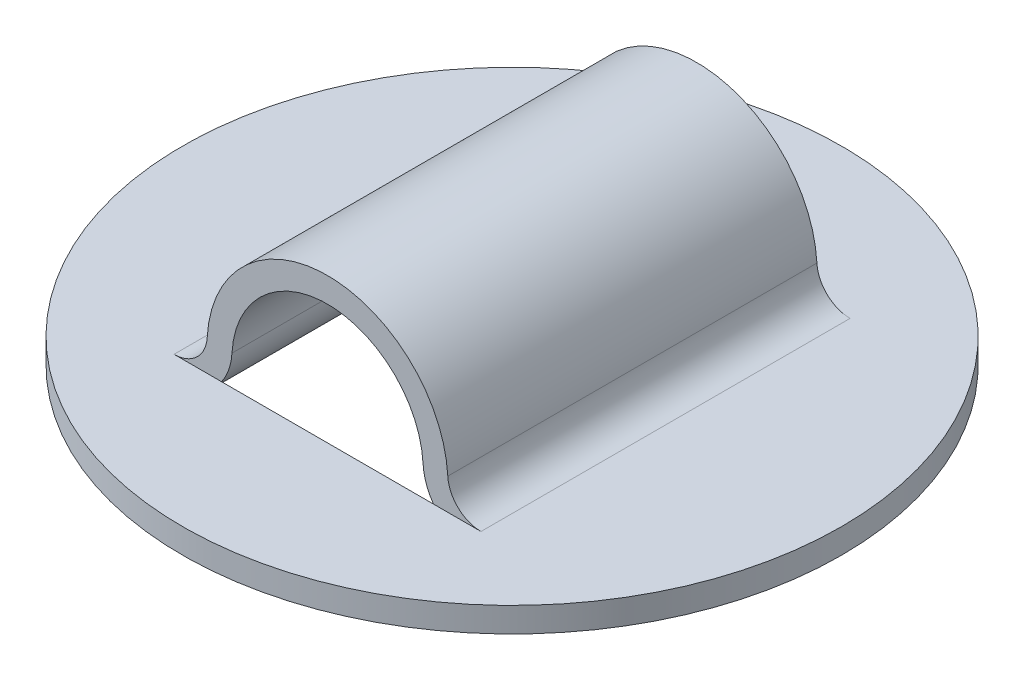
ISO-10303-21;
HEADER;
FILE_DESCRIPTION(('STEP AP214'),'2;1');
FILE_NAME('part.step','',(''),(''),'','','');
FILE_SCHEMA(('AUTOMOTIVE_DESIGN { 1 0 10303 214 1 1 1 1 }'));
ENDSEC;
DATA;
#1=APPLICATION_CONTEXT('core data for automotive mechanical design processes');
#2=APPLICATION_PROTOCOL_DEFINITION('international standard','automotive_design',2000,#1);
#3=PRODUCT_CONTEXT('',#1,'mechanical');
#4=PRODUCT('Part','Part','',(#3));
#5=PRODUCT_RELATED_PRODUCT_CATEGORY('part','',(#4));
#6=PRODUCT_DEFINITION_FORMATION('','',#4);
#7=PRODUCT_DEFINITION_CONTEXT('part definition',#1,'design');
#8=PRODUCT_DEFINITION('design','',#6,#7);
#9=PRODUCT_DEFINITION_SHAPE('','',#8);
#10=(LENGTH_UNIT() NAMED_UNIT(*) SI_UNIT(.MILLI.,.METRE.));
#11=(NAMED_UNIT(*) PLANE_ANGLE_UNIT() SI_UNIT($,.RADIAN.));
#12=(NAMED_UNIT(*) SI_UNIT($,.STERADIAN.) SOLID_ANGLE_UNIT());
#13=UNCERTAINTY_MEASURE_WITH_UNIT(LENGTH_MEASURE(1.E-05),#10,'distance_accuracy_value','');
#14=(GEOMETRIC_REPRESENTATION_CONTEXT(3) GLOBAL_UNCERTAINTY_ASSIGNED_CONTEXT((#13)) GLOBAL_UNIT_ASSIGNED_CONTEXT((#10,
#11,#12)) REPRESENTATION_CONTEXT('',''));
#15=CARTESIAN_POINT('',(0.,0.,0.));
#16=DIRECTION('',(0.,0.,1.));
#17=DIRECTION('',(1.,0.,0.));
#18=AXIS2_PLACEMENT_3D('',#15,#16,#17);
#19=CARTESIAN_POINT('',(0.,1.1811,17.78));
#20=DIRECTION('',(0.,0.,-1.));
#21=DIRECTION('',(-1.,0.,0.));
#22=AXIS2_PLACEMENT_3D('',#19,#20,#21);
#23=CYLINDRICAL_SURFACE('',#22,5.8039);
#24=CARTESIAN_POINT('',(0.,1.1811,0.));
#25=DIRECTION('',(0.,0.,-1.));
#26=DIRECTION('',(-1.,0.,0.));
#27=AXIS2_PLACEMENT_3D('',#24,#25,#26);
#28=CIRCLE('',#27,5.8039);
#29=CARTESIAN_POINT('',(-5.79459472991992,1.50962264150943,0.));
#30=VERTEX_POINT('',#29);
#31=CARTESIAN_POINT('',(5.79459472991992,1.50962264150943,0.));
#32=VERTEX_POINT('',#31);
#33=EDGE_CURVE('E163',#30,#32,#28,.T.);
#34=ORIENTED_EDGE('',*,*,#33,.F.);
#35=DIRECTION('',(0.,0.,-1.));
#36=VECTOR('',#35,1.);
#37=CARTESIAN_POINT('',(-5.79459472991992,1.50962264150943,17.78));
#38=LINE('',#37,#36);
#39=CARTESIAN_POINT('',(-5.79459472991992,1.50962264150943,17.78));
#40=VERTEX_POINT('',#39);
#41=EDGE_CURVE('E126',#30,#40,#38,.F.);
#42=ORIENTED_EDGE('',*,*,#41,.T.);
#43=CARTESIAN_POINT('',(0.,1.1811,17.78));
#44=DIRECTION('',(0.,0.,-1.));
#45=DIRECTION('',(-1.,0.,0.));
#46=AXIS2_PLACEMENT_3D('',#43,#44,#45);
#47=CIRCLE('',#46,5.8039);
#48=CARTESIAN_POINT('',(5.79459472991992,1.50962264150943,17.78));
#49=VERTEX_POINT('',#48);
#50=EDGE_CURVE('E98',#40,#49,#47,.T.);
#51=ORIENTED_EDGE('',*,*,#50,.T.);
#52=DIRECTION('',(0.,0.,-1.));
#53=VECTOR('',#52,1.);
#54=CARTESIAN_POINT('',(5.79459472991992,1.50962264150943,17.78));
#55=LINE('',#54,#53);
#56=EDGE_CURVE('E101',#49,#32,#55,.T.);
#57=ORIENTED_EDGE('',*,*,#56,.T.);
#58=EDGE_LOOP('',(#34,#42,#51,#57));
#59=FACE_BOUND('',#58,.T.);
#60=ADVANCED_FACE('F18',(#59),#23,.T.);
#61=CARTESIAN_POINT('',(-7.39222916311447,1.6002,17.78));
#62=DIRECTION('',(0.,0.,-1.));
#63=DIRECTION('',(-1.,0.,0.));
#64=AXIS2_PLACEMENT_3D('',#61,#62,#63);
#65=CYLINDRICAL_SURFACE('',#64,1.6002);
#66=CARTESIAN_POINT('',(-7.39222916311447,1.6002,17.78));
#67=DIRECTION('',(0.,0.,-1.));
#68=DIRECTION('',(-1.,0.,0.));
#69=AXIS2_PLACEMENT_3D('',#66,#67,#68);
#70=CIRCLE('',#69,1.6002);
#71=CARTESIAN_POINT('',(-7.39222916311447,0.,17.78));
#72=VERTEX_POINT('',#71);
#73=EDGE_CURVE('E21',#72,#40,#70,.F.);
#74=ORIENTED_EDGE('',*,*,#73,.T.);
#75=ORIENTED_EDGE('',*,*,#41,.F.);
#76=CARTESIAN_POINT('',(-7.39222916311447,1.6002,0.));
#77=DIRECTION('',(0.,0.,-1.));
#78=DIRECTION('',(-1.,0.,0.));
#79=AXIS2_PLACEMENT_3D('',#76,#77,#78);
#80=CIRCLE('',#79,1.6002);
#81=CARTESIAN_POINT('',(-7.39222916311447,0.,0.));
#82=VERTEX_POINT('',#81);
#83=EDGE_CURVE('E117',#82,#30,#80,.F.);
#84=ORIENTED_EDGE('',*,*,#83,.F.);
#85=DIRECTION('',(0.,0.,1.));
#86=VECTOR('',#85,1.);
#87=CARTESIAN_POINT('',(-7.39222916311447,0.,17.78));
#88=LINE('',#87,#86);
#89=EDGE_CURVE('E108',#82,#72,#88,.T.);
#90=ORIENTED_EDGE('',*,*,#89,.T.);
#91=EDGE_LOOP('',(#74,#75,#84,#90));
#92=FACE_BOUND('',#91,.T.);
#93=ADVANCED_FACE('F115',(#92),#65,.F.);
#94=CARTESIAN_POINT('',(7.39222916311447,1.6002,17.78));
#95=DIRECTION('',(0.,0.,-1.));
#96=DIRECTION('',(-1.,0.,0.));
#97=AXIS2_PLACEMENT_3D('',#94,#95,#96);
#98=CYLINDRICAL_SURFACE('',#97,1.6002);
#99=CARTESIAN_POINT('',(7.39222916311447,1.6002,17.78));
#100=DIRECTION('',(0.,0.,-1.));
#101=DIRECTION('',(-1.,0.,0.));
#102=AXIS2_PLACEMENT_3D('',#99,#100,#101);
#103=CIRCLE('',#102,1.6002);
#104=CARTESIAN_POINT('',(7.39222916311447,0.,17.78));
#105=VERTEX_POINT('',#104);
#106=EDGE_CURVE('E169',#49,#105,#103,.F.);
#107=ORIENTED_EDGE('',*,*,#106,.T.);
#108=DIRECTION('',(0.,0.,1.));
#109=VECTOR('',#108,1.);
#110=CARTESIAN_POINT('',(7.39222916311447,0.,17.78));
#111=LINE('',#110,#109);
#112=CARTESIAN_POINT('',(7.39222916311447,0.,0.));
#113=VERTEX_POINT('',#112);
#114=EDGE_CURVE('E124',#105,#113,#111,.F.);
#115=ORIENTED_EDGE('',*,*,#114,.T.);
#116=CARTESIAN_POINT('',(7.39222916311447,1.6002,0.));
#117=DIRECTION('',(0.,0.,-1.));
#118=DIRECTION('',(-1.,0.,0.));
#119=AXIS2_PLACEMENT_3D('',#116,#117,#118);
#120=CIRCLE('',#119,1.6002);
#121=EDGE_CURVE('E167',#32,#113,#120,.F.);
#122=ORIENTED_EDGE('',*,*,#121,.F.);
#123=ORIENTED_EDGE('',*,*,#56,.F.);
#124=EDGE_LOOP('',(#107,#115,#122,#123));
#125=FACE_BOUND('',#124,.T.);
#126=ADVANCED_FACE('F205',(#125),#98,.F.);
#127=CARTESIAN_POINT('',(-7.39222916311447,1.6002,17.78));
#128=DIRECTION('',(0.,0.,-1.));
#129=DIRECTION('',(-1.,0.,0.));
#130=AXIS2_PLACEMENT_3D('',#127,#128,#129);
#131=PLANE('',#130);
#132=ORIENTED_EDGE('',*,*,#106,.F.);
#133=ORIENTED_EDGE('',*,*,#50,.F.);
#134=ORIENTED_EDGE('',*,*,#73,.F.);
#135=DIRECTION('',(1.,0.,0.));
#136=VECTOR('',#135,1.);
#137=CARTESIAN_POINT('',(7.39222916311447,0.,17.78));
#138=LINE('',#137,#136);
#139=CARTESIAN_POINT('',(-5.10185889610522,0.,17.78));
#140=VERTEX_POINT('',#139);
#141=EDGE_CURVE('E95',#72,#140,#138,.T.);
#142=ORIENTED_EDGE('',*,*,#141,.T.);
#143=CARTESIAN_POINT('',(-7.39222916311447,1.6002,17.78));
#144=DIRECTION('',(0.,0.,-1.));
#145=DIRECTION('',(-1.,0.,0.));
#146=AXIS2_PLACEMENT_3D('',#143,#144,#145);
#147=CIRCLE('',#146,2.794);
#148=CARTESIAN_POINT('',(-4.60270872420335,1.44204905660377,17.78));
#149=VERTEX_POINT('',#148);
#150=EDGE_CURVE('E144',#149,#140,#147,.T.);
#151=ORIENTED_EDGE('',*,*,#150,.F.);
#152=CARTESIAN_POINT('',(0.,1.1811,17.78));
#153=DIRECTION('',(0.,0.,-1.));
#154=DIRECTION('',(-1.,0.,0.));
#155=AXIS2_PLACEMENT_3D('',#152,#153,#154);
#156=CIRCLE('',#155,4.6101);
#157=CARTESIAN_POINT('',(4.60270872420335,1.44204905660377,17.78));
#158=VERTEX_POINT('',#157);
#159=EDGE_CURVE('E120',#149,#158,#156,.T.);
#160=ORIENTED_EDGE('',*,*,#159,.T.);
#161=CARTESIAN_POINT('',(7.39222916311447,1.6002,17.78));
#162=DIRECTION('',(0.,0.,-1.));
#163=DIRECTION('',(-1.,0.,0.));
#164=AXIS2_PLACEMENT_3D('',#161,#162,#163);
#165=CIRCLE('',#164,2.794);
#166=CARTESIAN_POINT('',(5.10185889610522,0.,17.78));
#167=VERTEX_POINT('',#166);
#168=EDGE_CURVE('E149',#167,#158,#165,.T.);
#169=ORIENTED_EDGE('',*,*,#168,.F.);
#170=DIRECTION('',(1.,0.,0.));
#171=VECTOR('',#170,1.);
#172=CARTESIAN_POINT('',(7.39222916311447,0.,17.78));
#173=LINE('',#172,#171);
#174=EDGE_CURVE('E113',#167,#105,#173,.T.);
#175=ORIENTED_EDGE('',*,*,#174,.T.);
#176=EDGE_LOOP('',(#132,#133,#134,#142,#151,#160,#169,#175));
#177=FACE_BOUND('',#176,.T.);
#178=ADVANCED_FACE('F93',(#177),#131,.F.);
#179=CARTESIAN_POINT('',(-7.39222916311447,1.6002,0.));
#180=DIRECTION('',(0.,0.,-1.));
#181=DIRECTION('',(-1.,0.,0.));
#182=AXIS2_PLACEMENT_3D('',#179,#180,#181);
#183=PLANE('',#182);
#184=ORIENTED_EDGE('',*,*,#83,.T.);
#185=ORIENTED_EDGE('',*,*,#33,.T.);
#186=ORIENTED_EDGE('',*,*,#121,.T.);
#187=DIRECTION('',(1.,0.,0.));
#188=VECTOR('',#187,1.);
#189=CARTESIAN_POINT('',(7.39222916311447,0.,0.));
#190=LINE('',#189,#188);
#191=CARTESIAN_POINT('',(5.10185889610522,0.,0.));
#192=VERTEX_POINT('',#191);
#193=EDGE_CURVE('E157',#113,#192,#190,.F.);
#194=ORIENTED_EDGE('',*,*,#193,.T.);
#195=CARTESIAN_POINT('',(7.39222916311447,1.6002,0.));
#196=DIRECTION('',(0.,0.,-1.));
#197=DIRECTION('',(-1.,0.,0.));
#198=AXIS2_PLACEMENT_3D('',#195,#196,#197);
#199=CIRCLE('',#198,2.794);
#200=CARTESIAN_POINT('',(4.60270872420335,1.44204905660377,0.));
#201=VERTEX_POINT('',#200);
#202=EDGE_CURVE('E152',#201,#192,#199,.F.);
#203=ORIENTED_EDGE('',*,*,#202,.F.);
#204=CARTESIAN_POINT('',(0.,1.1811,0.));
#205=DIRECTION('',(0.,0.,-1.));
#206=DIRECTION('',(-1.,0.,0.));
#207=AXIS2_PLACEMENT_3D('',#204,#205,#206);
#208=CIRCLE('',#207,4.6101);
#209=CARTESIAN_POINT('',(-4.60270872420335,1.44204905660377,0.));
#210=VERTEX_POINT('',#209);
#211=EDGE_CURVE('E160',#201,#210,#208,.F.);
#212=ORIENTED_EDGE('',*,*,#211,.T.);
#213=CARTESIAN_POINT('',(-7.39222916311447,1.6002,0.));
#214=DIRECTION('',(0.,0.,-1.));
#215=DIRECTION('',(-1.,0.,0.));
#216=AXIS2_PLACEMENT_3D('',#213,#214,#215);
#217=CIRCLE('',#216,2.794);
#218=CARTESIAN_POINT('',(-5.10185889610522,0.,0.));
#219=VERTEX_POINT('',#218);
#220=EDGE_CURVE('E139',#219,#210,#217,.F.);
#221=ORIENTED_EDGE('',*,*,#220,.F.);
#222=DIRECTION('',(1.,0.,0.));
#223=VECTOR('',#222,1.);
#224=CARTESIAN_POINT('',(7.39222916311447,0.,0.));
#225=LINE('',#224,#223);
#226=EDGE_CURVE('E118',#219,#82,#225,.F.);
#227=ORIENTED_EDGE('',*,*,#226,.T.);
#228=EDGE_LOOP('',(#184,#185,#186,#194,#203,#212,#221,#227));
#229=FACE_BOUND('',#228,.T.);
#230=ADVANCED_FACE('F173',(#229),#183,.T.);
#231=CARTESIAN_POINT('',(0.,1.1811,17.78));
#232=DIRECTION('',(0.,0.,-1.));
#233=DIRECTION('',(-1.,0.,0.));
#234=AXIS2_PLACEMENT_3D('',#231,#232,#233);
#235=CYLINDRICAL_SURFACE('',#234,4.6101);
#236=ORIENTED_EDGE('',*,*,#159,.F.);
#237=DIRECTION('',(0.,0.,-1.));
#238=VECTOR('',#237,1.);
#239=CARTESIAN_POINT('',(-4.60270872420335,1.44204905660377,17.78));
#240=LINE('',#239,#238);
#241=EDGE_CURVE('E141',#210,#149,#240,.F.);
#242=ORIENTED_EDGE('',*,*,#241,.F.);
#243=ORIENTED_EDGE('',*,*,#211,.F.);
#244=DIRECTION('',(0.,0.,-1.));
#245=VECTOR('',#244,1.);
#246=CARTESIAN_POINT('',(4.60270872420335,1.44204905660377,17.78));
#247=LINE('',#246,#245);
#248=EDGE_CURVE('E151',#158,#201,#247,.T.);
#249=ORIENTED_EDGE('',*,*,#248,.F.);
#250=EDGE_LOOP('',(#236,#242,#243,#249));
#251=FACE_BOUND('',#250,.T.);
#252=ADVANCED_FACE('F226',(#251),#235,.F.);
#253=CARTESIAN_POINT('',(7.39222916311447,0.,17.78));
#254=DIRECTION('',(0.,-1.,0.));
#255=DIRECTION('',(1.,0.,0.));
#256=AXIS2_PLACEMENT_3D('',#253,#254,#255);
#257=PLANE('',#256);
#258=ORIENTED_EDGE('',*,*,#193,.F.);
#259=ORIENTED_EDGE('',*,*,#114,.F.);
#260=ORIENTED_EDGE('',*,*,#174,.F.);
#261=DIRECTION('',(1.,0.,0.));
#262=VECTOR('',#261,1.);
#263=CARTESIAN_POINT('',(7.39222916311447,0.,17.78));
#264=LINE('',#263,#262);
#265=EDGE_CURVE('E111',#167,#140,#264,.F.);
#266=ORIENTED_EDGE('',*,*,#265,.T.);
#267=ORIENTED_EDGE('',*,*,#141,.F.);
#268=ORIENTED_EDGE('',*,*,#89,.F.);
#269=ORIENTED_EDGE('',*,*,#226,.F.);
#270=DIRECTION('',(1.,0.,0.));
#271=VECTOR('',#270,1.);
#272=CARTESIAN_POINT('',(7.39222916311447,0.,0.));
#273=LINE('',#272,#271);
#274=EDGE_CURVE('E138',#192,#219,#273,.F.);
#275=ORIENTED_EDGE('',*,*,#274,.F.);
#276=EDGE_LOOP('',(#258,#259,#260,#266,#267,#268,#269,#275));
#277=FACE_BOUND('',#276,.T.);
#278=CARTESIAN_POINT('',(0.,0.,8.89));
#279=DIRECTION('',(0.,-1.,0.));
#280=DIRECTION('',(1.,0.,0.));
#281=AXIS2_PLACEMENT_3D('',#278,#279,#280);
#282=CIRCLE('',#281,15.875);
#283=CARTESIAN_POINT('',(15.875,0.,8.89));
#284=VERTEX_POINT('',#283);
#285=EDGE_CURVE('E154',#284,#284,#282,.T.);
#286=ORIENTED_EDGE('',*,*,#285,.F.);
#287=EDGE_LOOP('',(#286));
#288=FACE_BOUND('',#287,.T.);
#289=ADVANCED_FACE('F106',(#277,#288),#257,.F.);
#290=CARTESIAN_POINT('',(0.,0.,8.89));
#291=DIRECTION('',(0.,-1.,0.));
#292=DIRECTION('',(1.,0.,0.));
#293=AXIS2_PLACEMENT_3D('',#290,#291,#292);
#294=CYLINDRICAL_SURFACE('',#293,15.875);
#295=CARTESIAN_POINT('',(0.,-1.1938,8.89));
#296=DIRECTION('',(0.,-1.,0.));
#297=DIRECTION('',(1.,0.,0.));
#298=AXIS2_PLACEMENT_3D('',#295,#296,#297);
#299=CIRCLE('',#298,15.875);
#300=CARTESIAN_POINT('',(15.875,-1.1938,8.89));
#301=VERTEX_POINT('',#300);
#302=EDGE_CURVE('E130',#301,#301,#299,.F.);
#303=ORIENTED_EDGE('',*,*,#302,.T.);
#304=EDGE_LOOP('',(#303));
#305=FACE_BOUND('',#304,.T.);
#306=ORIENTED_EDGE('',*,*,#285,.T.);
#307=EDGE_LOOP('',(#306));
#308=FACE_BOUND('',#307,.T.);
#309=ADVANCED_FACE('F220',(#305,#308),#294,.T.);
#310=CARTESIAN_POINT('',(7.39222916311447,1.6002,17.78));
#311=DIRECTION('',(0.,0.,-1.));
#312=DIRECTION('',(-1.,0.,0.));
#313=AXIS2_PLACEMENT_3D('',#310,#311,#312);
#314=CYLINDRICAL_SURFACE('',#313,2.794);
#315=ORIENTED_EDGE('',*,*,#168,.T.);
#316=ORIENTED_EDGE('',*,*,#248,.T.);
#317=ORIENTED_EDGE('',*,*,#202,.T.);
#318=CARTESIAN_POINT('',(7.39222916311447,1.6002,0.));
#319=DIRECTION('',(0.,0.,-1.));
#320=DIRECTION('',(-1.,0.,0.));
#321=AXIS2_PLACEMENT_3D('',#318,#319,#320);
#322=CIRCLE('',#321,2.794);
#323=CARTESIAN_POINT('',(7.39222916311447,-1.1938,0.));
#324=VERTEX_POINT('',#323);
#325=EDGE_CURVE('E134',#324,#192,#322,.T.);
#326=ORIENTED_EDGE('',*,*,#325,.F.);
#327=DIRECTION('',(0.,0.,1.));
#328=VECTOR('',#327,1.);
#329=CARTESIAN_POINT('',(7.39222916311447,-1.1938,17.78));
#330=LINE('',#329,#328);
#331=CARTESIAN_POINT('',(7.39222916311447,-1.1938,17.78));
#332=VERTEX_POINT('',#331);
#333=EDGE_CURVE('E133',#324,#332,#330,.T.);
#334=ORIENTED_EDGE('',*,*,#333,.T.);
#335=CARTESIAN_POINT('',(7.39222916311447,1.6002,17.78));
#336=DIRECTION('',(0.,0.,-1.));
#337=DIRECTION('',(-1.,0.,0.));
#338=AXIS2_PLACEMENT_3D('',#335,#336,#337);
#339=CIRCLE('',#338,2.794);
#340=EDGE_CURVE('E146',#332,#167,#339,.T.);
#341=ORIENTED_EDGE('',*,*,#340,.T.);
#342=EDGE_LOOP('',(#315,#316,#317,#326,#334,#341));
#343=FACE_BOUND('',#342,.T.);
#344=ADVANCED_FACE('F198',(#343),#314,.T.);
#345=CARTESIAN_POINT('',(7.39222916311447,1.6002,17.78));
#346=DIRECTION('',(0.,0.,1.));
#347=DIRECTION('',(1.,0.,0.));
#348=AXIS2_PLACEMENT_3D('',#345,#346,#347);
#349=PLANE('',#348);
#350=DIRECTION('',(1.,0.,0.));
#351=VECTOR('',#350,1.);
#352=CARTESIAN_POINT('',(-15.875,-1.1938,17.78));
#353=LINE('',#352,#351);
#354=CARTESIAN_POINT('',(-7.39222916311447,-1.1938,17.78));
#355=VERTEX_POINT('',#354);
#356=EDGE_CURVE('E184',#332,#355,#353,.F.);
#357=ORIENTED_EDGE('',*,*,#356,.T.);
#358=CARTESIAN_POINT('',(-7.39222916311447,1.6002,17.78));
#359=DIRECTION('',(0.,0.,-1.));
#360=DIRECTION('',(-1.,0.,0.));
#361=AXIS2_PLACEMENT_3D('',#358,#359,#360);
#362=CIRCLE('',#361,2.794);
#363=EDGE_CURVE('E142',#140,#355,#362,.T.);
#364=ORIENTED_EDGE('',*,*,#363,.F.);
#365=ORIENTED_EDGE('',*,*,#265,.F.);
#366=ORIENTED_EDGE('',*,*,#340,.F.);
#367=EDGE_LOOP('',(#357,#364,#365,#366));
#368=FACE_BOUND('',#367,.T.);
#369=ADVANCED_FACE('F207',(#368),#349,.F.);
#370=CARTESIAN_POINT('',(-7.39222916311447,1.6002,17.78));
#371=DIRECTION('',(0.,0.,-1.));
#372=DIRECTION('',(-1.,0.,0.));
#373=AXIS2_PLACEMENT_3D('',#370,#371,#372);
#374=CYLINDRICAL_SURFACE('',#373,2.794);
#375=ORIENTED_EDGE('',*,*,#220,.T.);
#376=ORIENTED_EDGE('',*,*,#241,.T.);
#377=ORIENTED_EDGE('',*,*,#150,.T.);
#378=ORIENTED_EDGE('',*,*,#363,.T.);
#379=DIRECTION('',(0.,0.,1.));
#380=VECTOR('',#379,1.);
#381=CARTESIAN_POINT('',(-7.39222916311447,-1.1938,17.78));
#382=LINE('',#381,#380);
#383=CARTESIAN_POINT('',(-7.39222916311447,-1.1938,0.));
#384=VERTEX_POINT('',#383);
#385=EDGE_CURVE('E27',#355,#384,#382,.F.);
#386=ORIENTED_EDGE('',*,*,#385,.T.);
#387=CARTESIAN_POINT('',(-7.39222916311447,1.6002,0.));
#388=DIRECTION('',(0.,0.,-1.));
#389=DIRECTION('',(-1.,0.,0.));
#390=AXIS2_PLACEMENT_3D('',#387,#388,#389);
#391=CIRCLE('',#390,2.794);
#392=EDGE_CURVE('E35',#219,#384,#391,.T.);
#393=ORIENTED_EDGE('',*,*,#392,.F.);
#394=EDGE_LOOP('',(#375,#376,#377,#378,#386,#393));
#395=FACE_BOUND('',#394,.T.);
#396=ADVANCED_FACE('F211',(#395),#374,.T.);
#397=CARTESIAN_POINT('',(7.39222916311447,1.6002,0.));
#398=DIRECTION('',(0.,0.,1.));
#399=DIRECTION('',(1.,0.,0.));
#400=AXIS2_PLACEMENT_3D('',#397,#398,#399);
#401=PLANE('',#400);
#402=DIRECTION('',(1.,0.,0.));
#403=VECTOR('',#402,1.);
#404=CARTESIAN_POINT('',(-15.875,-1.1938,0.));
#405=LINE('',#404,#403);
#406=EDGE_CURVE('E11',#384,#324,#405,.T.);
#407=ORIENTED_EDGE('',*,*,#406,.T.);
#408=ORIENTED_EDGE('',*,*,#325,.T.);
#409=ORIENTED_EDGE('',*,*,#274,.T.);
#410=ORIENTED_EDGE('',*,*,#392,.T.);
#411=EDGE_LOOP('',(#407,#408,#409,#410));
#412=FACE_BOUND('',#411,.T.);
#413=ADVANCED_FACE('F177',(#412),#401,.T.);
#414=CARTESIAN_POINT('',(-15.875,-1.1938,17.78));
#415=DIRECTION('',(0.,1.,0.));
#416=DIRECTION('',(0.,0.,1.));
#417=AXIS2_PLACEMENT_3D('',#414,#415,#416);
#418=PLANE('',#417);
#419=ORIENTED_EDGE('',*,*,#385,.F.);
#420=ORIENTED_EDGE('',*,*,#356,.F.);
#421=ORIENTED_EDGE('',*,*,#333,.F.);
#422=ORIENTED_EDGE('',*,*,#406,.F.);
#423=EDGE_LOOP('',(#419,#420,#421,#422));
#424=FACE_BOUND('',#423,.T.);
#425=ORIENTED_EDGE('',*,*,#302,.F.);
#426=EDGE_LOOP('',(#425));
#427=FACE_BOUND('',#426,.T.);
#428=ADVANCED_FACE('F213',(#424,#427),#418,.F.);
#429=CLOSED_SHELL('',(#60,#93,#126,#178,#230,#252,#289,#309,#344,#369,#396,#413,#428));
#430=MANIFOLD_SOLID_BREP('B1',#429);
#431=ADVANCED_BREP_SHAPE_REPRESENTATION('',(#18,#430),#14);
#432=SHAPE_DEFINITION_REPRESENTATION(#9,#431);
ENDSEC;
END-ISO-10303-21;
